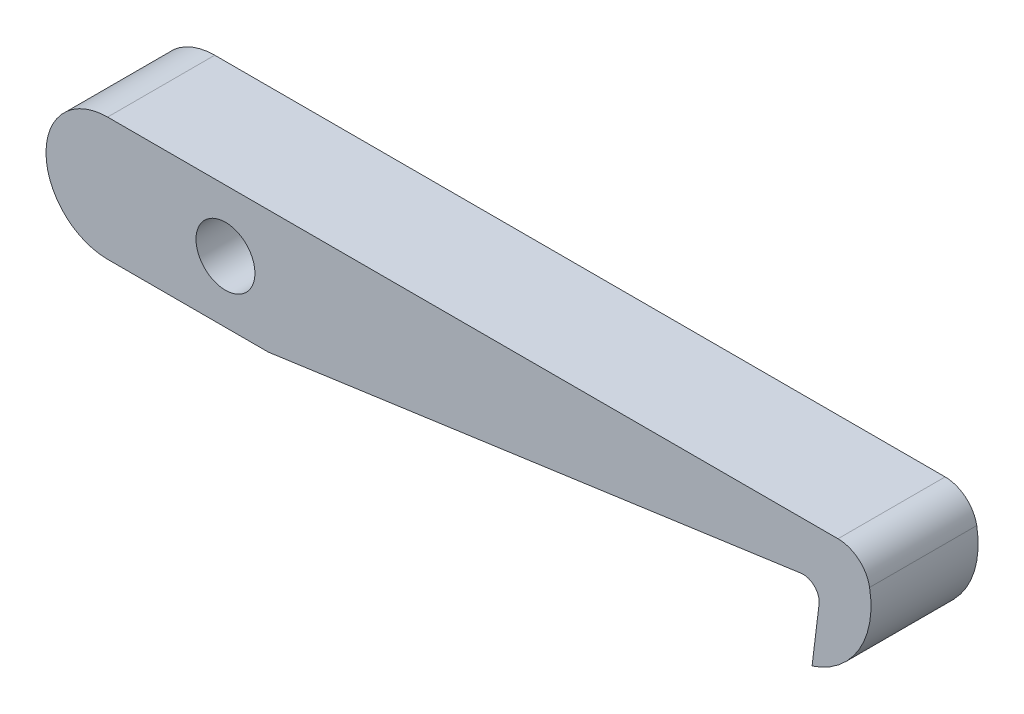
from build123d import *

# Parameters (mm, degrees)
SKIZZE1_R               = 2.75
LINEAR_AUSTRAGEN1_DEPTH = 10


with BuildPart() as part:
    # Skizze1 → Linear austragen1 (new body)
    with BuildSketch(Plane.XY):
        with BuildLine():
            Line((-11, 5.75), (57.16830726, 5.75))
            ThreePointArc((57.16830726, 5.75), (59.089211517, 5.054371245), (60.119291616, 3.290084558))
            ThreePointArc((60.119291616, 3.290084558), (59.127731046, -2.236314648), (54.748427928, -5.75))
            Line((54.748427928, -5.75), (55.401297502, -0.432804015))
            ThreePointArc((55.401297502, -0.432804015), (54.963842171, 0.819875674), (53.703718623, 1.235402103))
            Line((53.703718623, 1.235402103), (4, -5.75))
            Line((4, -5.75), (-11, -5.75))
            ThreePointArc((-11, -5.75), (-16.75, 0), (-11, 5.75))
        make_face()
        with Locations(Location((0, 0, 0), (0, 0, 180))):
            Circle(SKIZZE1_R, mode=Mode.SUBTRACT)
    extrude(amount=LINEAR_AUSTRAGEN1_DEPTH)


solid = part.part
